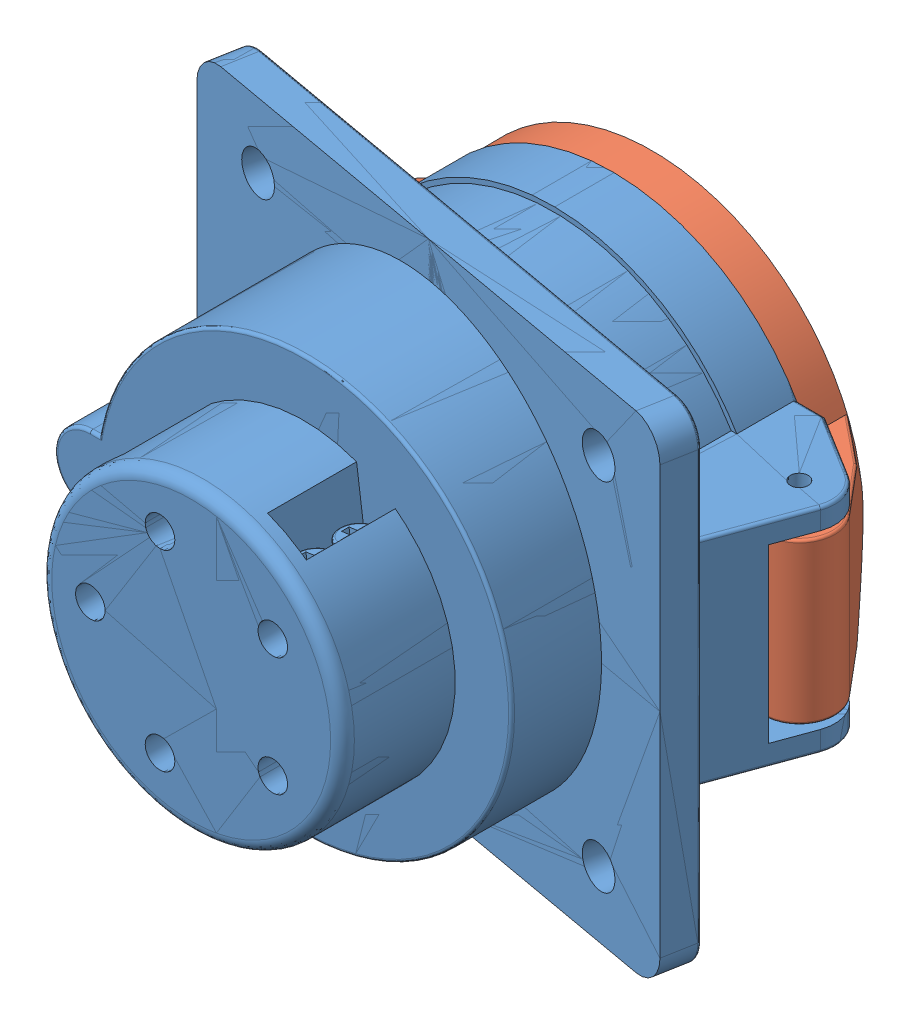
SolidWorks assembly Сборка 425-32.SLDASM, configuration По умолчанию (file format 10000). Lengths in mm.
Overall size (97.05 82 79.08).
2 component instances, 2 part files, 3 mates.
Components (placement in the parent):
- Корпус 425-1: Корпус 425.SLDPRT [По умолчанию] at (-2.5802 -2.3896 96.0264) size (97.05 82 71)
- Крышка 425, 424,-1: Крышка 425, 424,.SLDPRT [По умолчанию] at (-2.5802 -2.3896 46.0264) x (1 0 0) z (0 0 -1) size (91 71 25.59)
Mates (geometry in assembly coordinates):
- Концентричный1: concentric anti-aligned: cylinder of Корпус 425-1 through (-2.5802 -2.3896 54.0264) axis (0 0 -1) radius 35.8; cylinder of Крышка 425, 424,-1 through (-2.5802 -2.3896 38.5264) axis (0 0 1) radius 27.5
- Параллельность1: parallel aligned: plane of Корпус 425-1 through (-2.5802 38.6104 96.0264) normal (0 1 0); plane of Крышка 425, 424,-1 through (40.4198 11.1104 55.54) normal (0 1 0)
- Совпадение1: coincident anti-aligned: plane of Корпус 425-1 through (-2.5802 -2.3896 44.0264) normal (0 0 -1); plane of Крышка 425, 424,-1 through (-2.5802 -2.3896 44.0264) normal (0 0 1)
